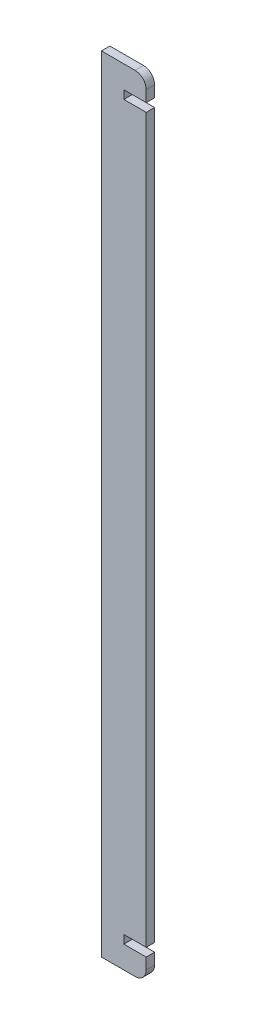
from build123d import *

# Parameters (mm, degrees)
SKETCH1_W           = 101.6
SKETCH1_H           = 1778
BOSS_EXTRUDE1_DEPTH = 19.05
SKETCH3_W           = 50.8
SKETCH3_H           = 19.05
CUT_EXTRUDE1_DEPTH  = 891.653997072
FILLET1_R           = 25.4


with BuildPart() as part:
    # Sketch1 → Boss-Extrude1 (new body)
    with BuildSketch(Plane.XY):
        Rectangle(SKETCH1_W, SKETCH1_H)
    extrude(amount=BOSS_EXTRUDE1_DEPTH)

    # Sketch3 → Cut-Extrude1 (cut, through all)
    with BuildSketch(Plane(origin=(0, 0, 0), x_dir=(-1, 0, 0), z_dir=(0, 0, -1))):
        with Locations((-25.4, 828.675)):
            Rectangle(SKETCH3_W, SKETCH3_H)
        with Locations((-25.4, -828.675)):
            Rectangle(SKETCH3_W, SKETCH3_H)
    extrude(amount=-CUT_EXTRUDE1_DEPTH, mode=Mode.SUBTRACT)

    # Fillet1
    fillet1_edges = [part.edges().sort_by_distance(p)[0] for p in [
        (50.8, -889, 9.525),
        (50.8, 889, 9.525),
    ]]
    fillet(fillet1_edges, radius=FILLET1_R)


solid = part.part
